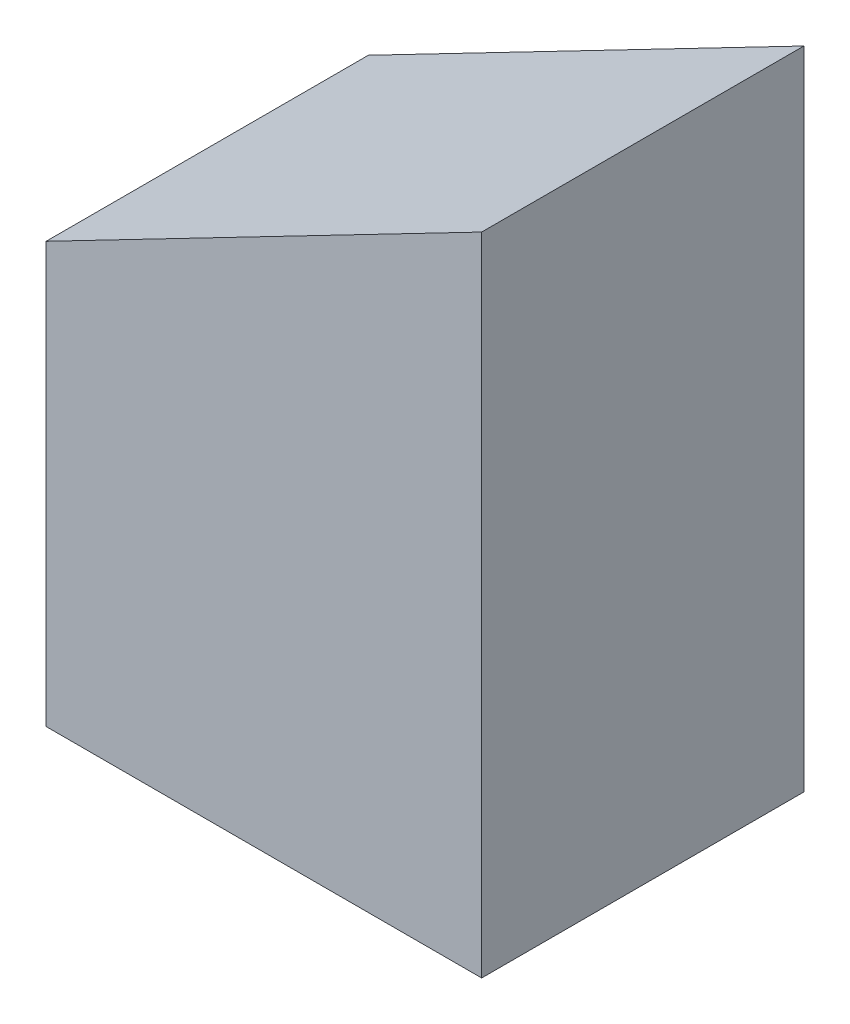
ISO-10303-21;
HEADER;
FILE_DESCRIPTION(('STEP AP214'),'2;1');
FILE_NAME('part.step','',(''),(''),'','','');
FILE_SCHEMA(('AUTOMOTIVE_DESIGN { 1 0 10303 214 1 1 1 1 }'));
ENDSEC;
DATA;
#1=APPLICATION_CONTEXT('core data for automotive mechanical design processes');
#2=APPLICATION_PROTOCOL_DEFINITION('international standard','automotive_design',2000,#1);
#3=PRODUCT_CONTEXT('',#1,'mechanical');
#4=PRODUCT('Part','Part','',(#3));
#5=PRODUCT_RELATED_PRODUCT_CATEGORY('part','',(#4));
#6=PRODUCT_DEFINITION_FORMATION('','',#4);
#7=PRODUCT_DEFINITION_CONTEXT('part definition',#1,'design');
#8=PRODUCT_DEFINITION('design','',#6,#7);
#9=PRODUCT_DEFINITION_SHAPE('','',#8);
#10=(LENGTH_UNIT() NAMED_UNIT(*) SI_UNIT(.MILLI.,.METRE.));
#11=(NAMED_UNIT(*) PLANE_ANGLE_UNIT() SI_UNIT($,.RADIAN.));
#12=(NAMED_UNIT(*) SI_UNIT($,.STERADIAN.) SOLID_ANGLE_UNIT());
#13=UNCERTAINTY_MEASURE_WITH_UNIT(LENGTH_MEASURE(1.E-05),#10,'distance_accuracy_value','');
#14=(GEOMETRIC_REPRESENTATION_CONTEXT(3) GLOBAL_UNCERTAINTY_ASSIGNED_CONTEXT((#13)) GLOBAL_UNIT_ASSIGNED_CONTEXT((#10,
#11,#12)) REPRESENTATION_CONTEXT('',''));
#15=CARTESIAN_POINT('',(0.,0.,0.));
#16=DIRECTION('',(0.,0.,1.));
#17=DIRECTION('',(1.,0.,0.));
#18=AXIS2_PLACEMENT_3D('',#15,#16,#17);
#19=CARTESIAN_POINT('',(-26.0927469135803,49.6860833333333,19.05));
#20=DIRECTION('',(1.,0.,0.));
#21=DIRECTION('',(0.,0.,-1.));
#22=AXIS2_PLACEMENT_3D('',#19,#20,#21);
#23=PLANE('',#22);
#24=DIRECTION('',(0.,-1.,0.));
#25=VECTOR('',#24,1.);
#26=CARTESIAN_POINT('',(-26.0927469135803,49.6860833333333,-19.05));
#27=LINE('',#26,#25);
#28=CARTESIAN_POINT('',(-26.0927469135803,49.6860833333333,-19.05));
#29=VERTEX_POINT('',#28);
#30=CARTESIAN_POINT('',(-26.0927469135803,0.,-19.05));
#31=VERTEX_POINT('',#30);
#32=EDGE_CURVE('E74',#29,#31,#27,.T.);
#33=ORIENTED_EDGE('',*,*,#32,.T.);
#34=DIRECTION('',(0.,0.,-1.));
#35=VECTOR('',#34,1.);
#36=CARTESIAN_POINT('',(-26.0927469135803,0.,19.05));
#37=LINE('',#36,#35);
#38=CARTESIAN_POINT('',(-26.0927469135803,0.,19.05));
#39=VERTEX_POINT('',#38);
#40=EDGE_CURVE('E11',#39,#31,#37,.T.);
#41=ORIENTED_EDGE('',*,*,#40,.F.);
#42=DIRECTION('',(0.,-1.,0.));
#43=VECTOR('',#42,1.);
#44=CARTESIAN_POINT('',(-26.0927469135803,49.6860833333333,19.05));
#45=LINE('',#44,#43);
#46=CARTESIAN_POINT('',(-26.0927469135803,49.6860833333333,19.05));
#47=VERTEX_POINT('',#46);
#48=EDGE_CURVE('E92',#47,#39,#45,.T.);
#49=ORIENTED_EDGE('',*,*,#48,.F.);
#50=DIRECTION('',(0.,0.,-1.));
#51=VECTOR('',#50,1.);
#52=CARTESIAN_POINT('',(-26.0927469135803,49.6860833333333,19.05));
#53=LINE('',#52,#51);
#54=EDGE_CURVE('E86',#47,#29,#53,.T.);
#55=ORIENTED_EDGE('',*,*,#54,.T.);
#56=EDGE_LOOP('',(#33,#41,#49,#55));
#57=FACE_BOUND('',#56,.T.);
#58=ADVANCED_FACE('F30',(#57),#23,.F.);
#59=CARTESIAN_POINT('',(-26.0927469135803,0.,19.05));
#60=DIRECTION('',(0.,1.,0.));
#61=DIRECTION('',(0.,0.,1.));
#62=AXIS2_PLACEMENT_3D('',#59,#60,#61);
#63=PLANE('',#62);
#64=DIRECTION('',(1.,0.,0.));
#65=VECTOR('',#64,1.);
#66=CARTESIAN_POINT('',(-26.0927469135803,0.,-19.05));
#67=LINE('',#66,#65);
#68=CARTESIAN_POINT('',(25.4060956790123,0.,-19.05));
#69=VERTEX_POINT('',#68);
#70=EDGE_CURVE('E70',#31,#69,#67,.T.);
#71=ORIENTED_EDGE('',*,*,#70,.T.);
#72=DIRECTION('',(0.,0.,-1.));
#73=VECTOR('',#72,1.);
#74=CARTESIAN_POINT('',(25.4060956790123,0.,19.05));
#75=LINE('',#74,#73);
#76=CARTESIAN_POINT('',(25.4060956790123,0.,19.05));
#77=VERTEX_POINT('',#76);
#78=EDGE_CURVE('E37',#77,#69,#75,.T.);
#79=ORIENTED_EDGE('',*,*,#78,.F.);
#80=DIRECTION('',(1.,0.,0.));
#81=VECTOR('',#80,1.);
#82=CARTESIAN_POINT('',(-26.0927469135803,0.,19.05));
#83=LINE('',#82,#81);
#84=EDGE_CURVE('E82',#39,#77,#83,.T.);
#85=ORIENTED_EDGE('',*,*,#84,.F.);
#86=ORIENTED_EDGE('',*,*,#40,.T.);
#87=EDGE_LOOP('',(#71,#79,#85,#86));
#88=FACE_BOUND('',#87,.T.);
#89=ADVANCED_FACE('F81',(#88),#63,.F.);
#90=CARTESIAN_POINT('',(25.4060956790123,0.,19.05));
#91=DIRECTION('',(-1.,0.,0.));
#92=DIRECTION('',(0.,0.,1.));
#93=AXIS2_PLACEMENT_3D('',#90,#91,#92);
#94=PLANE('',#93);
#95=DIRECTION('',(0.,1.,0.));
#96=VECTOR('',#95,1.);
#97=CARTESIAN_POINT('',(25.4060956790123,0.,-19.05));
#98=LINE('',#97,#96);
#99=CARTESIAN_POINT('',(25.4060956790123,76.3830833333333,-19.05));
#100=VERTEX_POINT('',#99);
#101=EDGE_CURVE('E75',#69,#100,#98,.T.);
#102=ORIENTED_EDGE('',*,*,#101,.T.);
#103=DIRECTION('',(0.,0.,-1.));
#104=VECTOR('',#103,1.);
#105=CARTESIAN_POINT('',(25.4060956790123,76.3830833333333,19.05));
#106=LINE('',#105,#104);
#107=CARTESIAN_POINT('',(25.4060956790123,76.3830833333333,19.05));
#108=VERTEX_POINT('',#107);
#109=EDGE_CURVE('E98',#108,#100,#106,.T.);
#110=ORIENTED_EDGE('',*,*,#109,.F.);
#111=DIRECTION('',(0.,1.,0.));
#112=VECTOR('',#111,1.);
#113=CARTESIAN_POINT('',(25.4060956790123,0.,19.05));
#114=LINE('',#113,#112);
#115=EDGE_CURVE('E49',#77,#108,#114,.T.);
#116=ORIENTED_EDGE('',*,*,#115,.F.);
#117=ORIENTED_EDGE('',*,*,#78,.T.);
#118=EDGE_LOOP('',(#102,#110,#116,#117));
#119=FACE_BOUND('',#118,.T.);
#120=ADVANCED_FACE('F101',(#119),#94,.F.);
#121=CARTESIAN_POINT('',(25.4060956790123,76.3830833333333,19.05));
#122=DIRECTION('',(0.460234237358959,-0.887797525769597,0.));
#123=DIRECTION('',(0.887797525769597,0.460234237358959,0.));
#124=AXIS2_PLACEMENT_3D('',#121,#122,#123);
#125=PLANE('',#124);
#126=DIRECTION('',(-0.887797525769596,-0.460234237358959,0.));
#127=VECTOR('',#126,1.);
#128=CARTESIAN_POINT('',(25.4060956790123,76.3830833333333,-19.05));
#129=LINE('',#128,#127);
#130=EDGE_CURVE('E90',#100,#29,#129,.T.);
#131=ORIENTED_EDGE('',*,*,#130,.T.);
#132=ORIENTED_EDGE('',*,*,#54,.F.);
#133=DIRECTION('',(-0.887797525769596,-0.460234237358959,0.));
#134=VECTOR('',#133,1.);
#135=CARTESIAN_POINT('',(25.4060956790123,76.3830833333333,19.05));
#136=LINE('',#135,#134);
#137=EDGE_CURVE('E44',#108,#47,#136,.T.);
#138=ORIENTED_EDGE('',*,*,#137,.F.);
#139=ORIENTED_EDGE('',*,*,#109,.T.);
#140=EDGE_LOOP('',(#131,#132,#138,#139));
#141=FACE_BOUND('',#140,.T.);
#142=ADVANCED_FACE('F103',(#141),#125,.F.);
#143=CARTESIAN_POINT('',(-26.0927469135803,0.,19.05));
#144=DIRECTION('',(0.,0.,1.));
#145=DIRECTION('',(1.,0.,0.));
#146=AXIS2_PLACEMENT_3D('',#143,#144,#145);
#147=PLANE('',#146);
#148=ORIENTED_EDGE('',*,*,#48,.T.);
#149=ORIENTED_EDGE('',*,*,#84,.T.);
#150=ORIENTED_EDGE('',*,*,#115,.T.);
#151=ORIENTED_EDGE('',*,*,#137,.T.);
#152=EDGE_LOOP('',(#148,#149,#150,#151));
#153=FACE_BOUND('',#152,.T.);
#154=ADVANCED_FACE('F104',(#153),#147,.T.);
#155=CARTESIAN_POINT('',(-26.0927469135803,0.,-19.05));
#156=DIRECTION('',(0.,0.,1.));
#157=DIRECTION('',(1.,0.,0.));
#158=AXIS2_PLACEMENT_3D('',#155,#156,#157);
#159=PLANE('',#158);
#160=ORIENTED_EDGE('',*,*,#32,.F.);
#161=ORIENTED_EDGE('',*,*,#130,.F.);
#162=ORIENTED_EDGE('',*,*,#101,.F.);
#163=ORIENTED_EDGE('',*,*,#70,.F.);
#164=EDGE_LOOP('',(#160,#161,#162,#163));
#165=FACE_BOUND('',#164,.T.);
#166=ADVANCED_FACE('F71',(#165),#159,.F.);
#167=CLOSED_SHELL('',(#58,#89,#120,#142,#154,#166));
#168=MANIFOLD_SOLID_BREP('B2',#167);
#169=ADVANCED_BREP_SHAPE_REPRESENTATION('',(#18,#168),#14);
#170=SHAPE_DEFINITION_REPRESENTATION(#9,#169);
ENDSEC;
END-ISO-10303-21;
